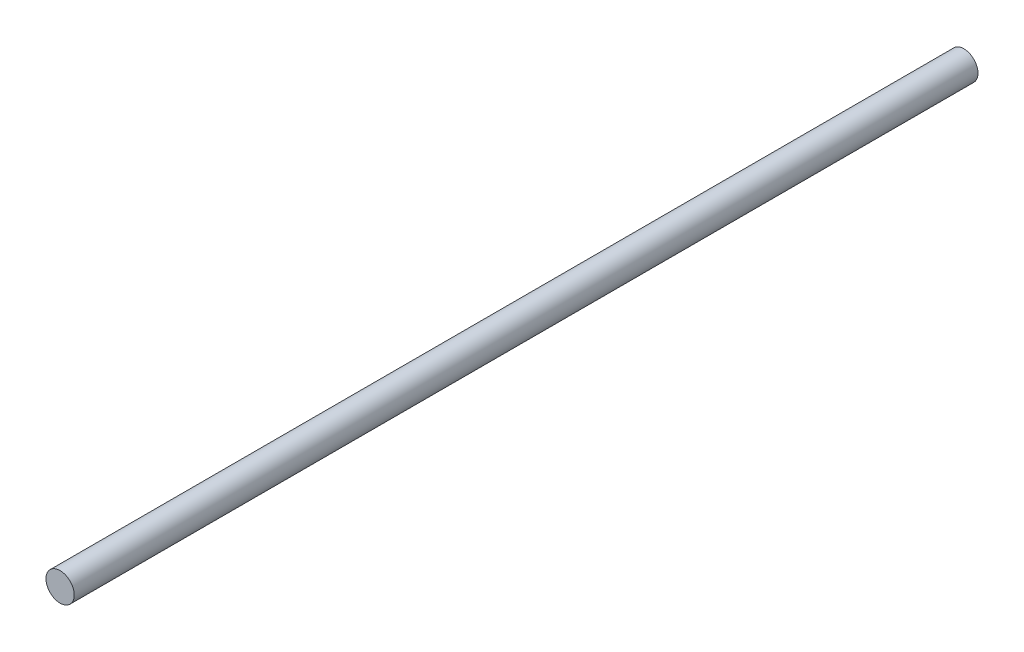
from build123d import *

# Parameters (mm, degrees)
SKETCH1_R           = 0.79375
BOSS_EXTRUDE1_DEPTH = 50.8


with BuildPart() as part:
    # Sketch1 → Boss-Extrude1 (new body)
    with BuildSketch(Plane.XY):
        Circle(SKETCH1_R)
    extrude(amount=BOSS_EXTRUDE1_DEPTH)


solid = part.part
